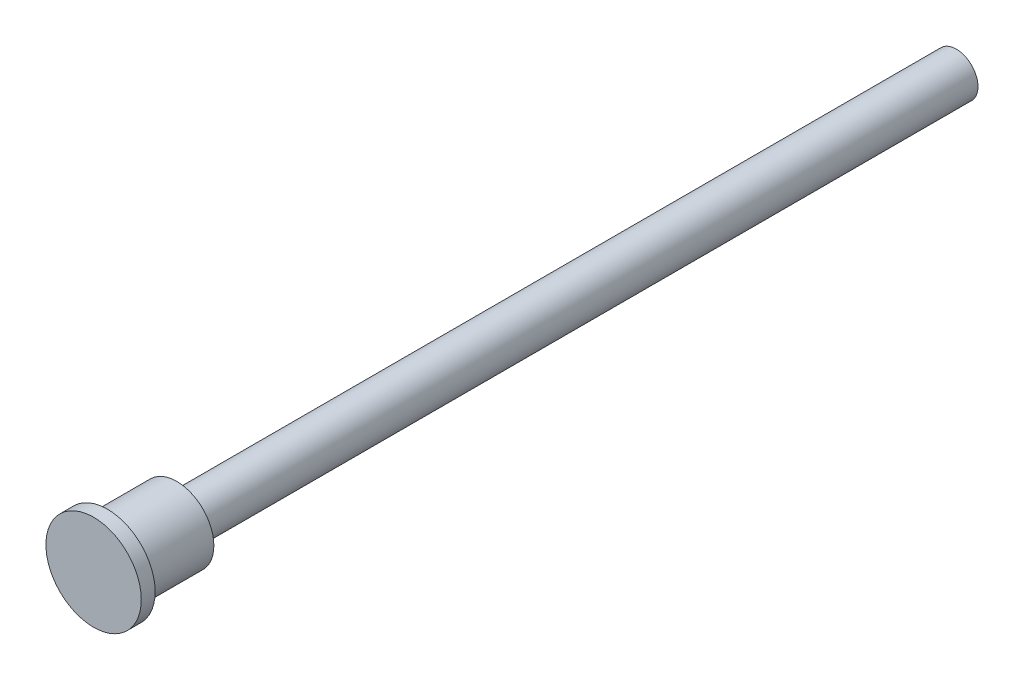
from build123d import *

# Parameters (mm, degrees)
SKETCH1_R           = 1.25
BOSS_EXTRUDE1_DEPTH = 44.99991
SKETCH2_R           = 2.141837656
BOSS_EXTRUDE2_DEPTH = 4
SKETCH3_R           = 2.752372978
BOSS_EXTRUDE3_DEPTH = 0.8


with BuildPart() as part:
    # Sketch1 → Boss-Extrude1 (new body)
    with BuildSketch(Plane.XY):
        Circle(SKETCH1_R)
    extrude(amount=BOSS_EXTRUDE1_DEPTH)

    # Sketch2 → Boss-Extrude2 (add)
    with BuildSketch(Plane.XY.offset(44.99991)):
        Circle(SKETCH2_R)
    extrude(amount=BOSS_EXTRUDE2_DEPTH)

    # Sketch3 → Boss-Extrude3 (add)
    with BuildSketch(Plane.XY.offset(48.99991)):
        Circle(SKETCH3_R)
    extrude(amount=BOSS_EXTRUDE3_DEPTH)


solid = part.part
